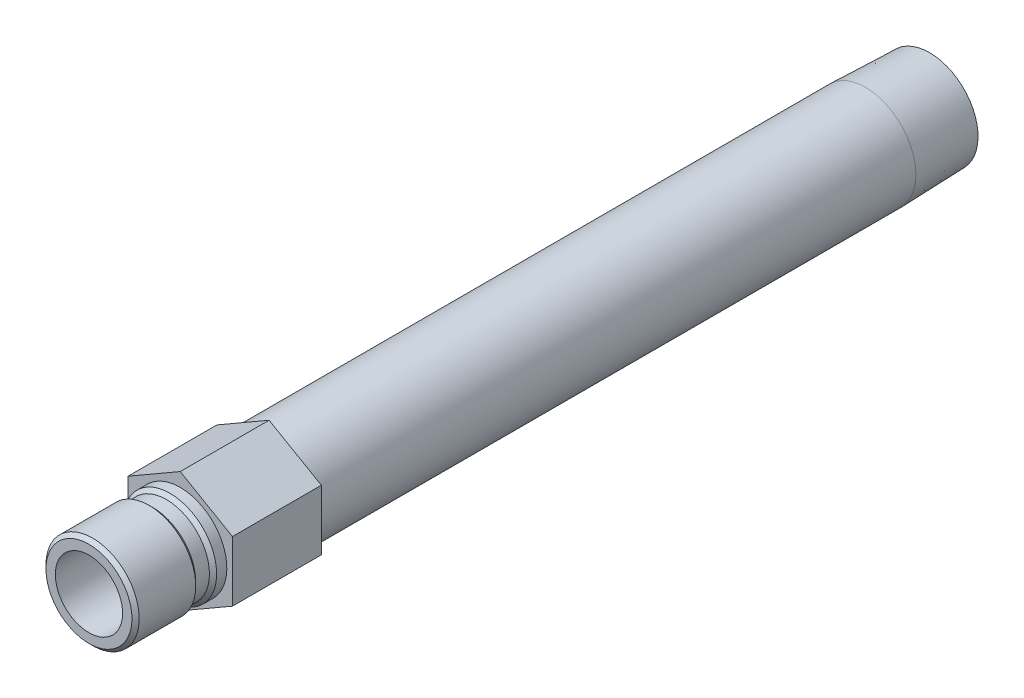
ISO-10303-21;
HEADER;
FILE_DESCRIPTION(('STEP AP214'),'2;1');
FILE_NAME('part.step','',(''),(''),'','','');
FILE_SCHEMA(('AUTOMOTIVE_DESIGN { 1 0 10303 214 1 1 1 1 }'));
ENDSEC;
DATA;
#1=APPLICATION_CONTEXT('core data for automotive mechanical design processes');
#2=APPLICATION_PROTOCOL_DEFINITION('international standard','automotive_design',2000,#1);
#3=PRODUCT_CONTEXT('',#1,'mechanical');
#4=PRODUCT('Part','Part','',(#3));
#5=PRODUCT_RELATED_PRODUCT_CATEGORY('part','',(#4));
#6=PRODUCT_DEFINITION_FORMATION('','',#4);
#7=PRODUCT_DEFINITION_CONTEXT('part definition',#1,'design');
#8=PRODUCT_DEFINITION('design','',#6,#7);
#9=PRODUCT_DEFINITION_SHAPE('','',#8);
#10=(LENGTH_UNIT() NAMED_UNIT(*) SI_UNIT(.MILLI.,.METRE.));
#11=(NAMED_UNIT(*) PLANE_ANGLE_UNIT() SI_UNIT($,.RADIAN.));
#12=(NAMED_UNIT(*) SI_UNIT($,.STERADIAN.) SOLID_ANGLE_UNIT());
#13=UNCERTAINTY_MEASURE_WITH_UNIT(LENGTH_MEASURE(1.E-05),#10,'distance_accuracy_value','');
#14=(GEOMETRIC_REPRESENTATION_CONTEXT(3) GLOBAL_UNCERTAINTY_ASSIGNED_CONTEXT((#13)) GLOBAL_UNIT_ASSIGNED_CONTEXT((#10,
#11,#12)) REPRESENTATION_CONTEXT('',''));
#15=CARTESIAN_POINT('',(0.,0.,0.));
#16=DIRECTION('',(0.,0.,1.));
#17=DIRECTION('',(1.,0.,0.));
#18=AXIS2_PLACEMENT_3D('',#15,#16,#17);
#19=CARTESIAN_POINT('',(0.,0.,0.));
#20=DIRECTION('',(0.,0.,-1.));
#21=DIRECTION('',(0.,1.,0.));
#22=AXIS2_PLACEMENT_3D('',#19,#20,#21);
#23=CYLINDRICAL_SURFACE('',#22,7.112);
#24=CARTESIAN_POINT('',(0.,0.,1.524));
#25=DIRECTION('',(0.,0.,-1.));
#26=DIRECTION('',(0.,1.,0.));
#27=AXIS2_PLACEMENT_3D('',#24,#25,#26);
#28=CIRCLE('',#27,7.112);
#29=CARTESIAN_POINT('',(0.,7.112,1.524));
#30=VERTEX_POINT('',#29);
#31=EDGE_CURVE('E147',#30,#30,#28,.T.);
#32=ORIENTED_EDGE('',*,*,#31,.T.);
#33=EDGE_LOOP('',(#32));
#34=FACE_BOUND('',#33,.T.);
#35=CARTESIAN_POINT('',(0.,0.,19.304));
#36=DIRECTION('',(0.,0.,-1.));
#37=DIRECTION('',(0.,1.,0.));
#38=AXIS2_PLACEMENT_3D('',#35,#36,#37);
#39=CIRCLE('',#38,7.112);
#40=CARTESIAN_POINT('',(0.,7.112,19.304));
#41=VERTEX_POINT('',#40);
#42=EDGE_CURVE('E42',#41,#41,#39,.T.);
#43=ORIENTED_EDGE('',*,*,#42,.F.);
#44=EDGE_LOOP('',(#43));
#45=FACE_BOUND('',#44,.T.);
#46=ADVANCED_FACE('F33',(#34,#45),#23,.F.);
#47=CARTESIAN_POINT('',(0.,7.112,19.304));
#48=DIRECTION('',(0.,0.,1.));
#49=DIRECTION('',(0.,-1.,0.));
#50=AXIS2_PLACEMENT_3D('',#47,#48,#49);
#51=PLANE('',#50);
#52=ORIENTED_EDGE('',*,*,#42,.T.);
#53=EDGE_LOOP('',(#52));
#54=FACE_BOUND('',#53,.T.);
#55=CARTESIAN_POINT('',(0.,0.,19.304));
#56=DIRECTION('',(0.,0.,-1.));
#57=DIRECTION('',(0.,1.,0.));
#58=AXIS2_PLACEMENT_3D('',#55,#56,#57);
#59=CIRCLE('',#58,9.0932);
#60=CARTESIAN_POINT('',(0.,9.0932,19.304));
#61=VERTEX_POINT('',#60);
#62=EDGE_CURVE('E180',#61,#61,#59,.T.);
#63=ORIENTED_EDGE('',*,*,#62,.F.);
#64=EDGE_LOOP('',(#63));
#65=FACE_BOUND('',#64,.T.);
#66=ADVANCED_FACE('F186',(#54,#65),#51,.T.);
#67=CARTESIAN_POINT('',(0.,0.,18.542));
#68=DIRECTION('',(0.,0.,-1.));
#69=DIRECTION('',(0.,1.,0.));
#70=AXIS2_PLACEMENT_3D('',#67,#68,#69);
#71=CONICAL_SURFACE('',#70,9.8552,0.785398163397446);
#72=ORIENTED_EDGE('',*,*,#62,.T.);
#73=EDGE_LOOP('',(#72));
#74=FACE_BOUND('',#73,.T.);
#75=CARTESIAN_POINT('',(0.,0.,18.542));
#76=DIRECTION('',(0.,0.,-1.));
#77=DIRECTION('',(0.,1.,0.));
#78=AXIS2_PLACEMENT_3D('',#75,#76,#77);
#79=CIRCLE('',#78,9.8552);
#80=CARTESIAN_POINT('',(0.,9.8552,18.542));
#81=VERTEX_POINT('',#80);
#82=EDGE_CURVE('E177',#81,#81,#79,.T.);
#83=ORIENTED_EDGE('',*,*,#82,.F.);
#84=EDGE_LOOP('',(#83));
#85=FACE_BOUND('',#84,.T.);
#86=ADVANCED_FACE('F194',(#74,#85),#71,.T.);
#87=CARTESIAN_POINT('',(0.,0.,0.));
#88=DIRECTION('',(0.,0.,-1.));
#89=DIRECTION('',(0.,1.,0.));
#90=AXIS2_PLACEMENT_3D('',#87,#88,#89);
#91=CYLINDRICAL_SURFACE('',#90,9.8552);
#92=ORIENTED_EDGE('',*,*,#82,.T.);
#93=EDGE_LOOP('',(#92));
#94=FACE_BOUND('',#93,.T.);
#95=CARTESIAN_POINT('',(0.,0.,6.5786));
#96=DIRECTION('',(0.,0.,-1.));
#97=DIRECTION('',(0.,1.,0.));
#98=AXIS2_PLACEMENT_3D('',#95,#96,#97);
#99=CIRCLE('',#98,9.8552);
#100=CARTESIAN_POINT('',(0.,9.8552,6.5786));
#101=VERTEX_POINT('',#100);
#102=EDGE_CURVE('E174',#101,#101,#99,.T.);
#103=ORIENTED_EDGE('',*,*,#102,.F.);
#104=EDGE_LOOP('',(#103));
#105=FACE_BOUND('',#104,.T.);
#106=ADVANCED_FACE('F249',(#94,#105),#91,.T.);
#107=CARTESIAN_POINT('',(0.,0.,5.8166));
#108=DIRECTION('',(0.,0.,1.));
#109=DIRECTION('',(0.,-1.,0.));
#110=AXIS2_PLACEMENT_3D('',#107,#108,#109);
#111=CONICAL_SURFACE('',#110,9.0932,0.785398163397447);
#112=ORIENTED_EDGE('',*,*,#102,.T.);
#113=EDGE_LOOP('',(#112));
#114=FACE_BOUND('',#113,.T.);
#115=CARTESIAN_POINT('',(0.,0.,5.8166));
#116=DIRECTION('',(0.,0.,-1.));
#117=DIRECTION('',(0.,1.,0.));
#118=AXIS2_PLACEMENT_3D('',#115,#116,#117);
#119=CIRCLE('',#118,9.0932);
#120=CARTESIAN_POINT('',(0.,9.0932,5.8166));
#121=VERTEX_POINT('',#120);
#122=EDGE_CURVE('E171',#121,#121,#119,.T.);
#123=ORIENTED_EDGE('',*,*,#122,.F.);
#124=EDGE_LOOP('',(#123));
#125=FACE_BOUND('',#124,.T.);
#126=ADVANCED_FACE('F245',(#114,#125),#111,.T.);
#127=CARTESIAN_POINT('',(0.,0.,0.));
#128=DIRECTION('',(0.,0.,-1.));
#129=DIRECTION('',(0.,1.,0.));
#130=AXIS2_PLACEMENT_3D('',#127,#128,#129);
#131=CYLINDRICAL_SURFACE('',#130,9.0932);
#132=ORIENTED_EDGE('',*,*,#122,.T.);
#133=EDGE_LOOP('',(#132));
#134=FACE_BOUND('',#133,.T.);
#135=CARTESIAN_POINT('',(0.,0.,2.921));
#136=DIRECTION('',(0.,0.,-1.));
#137=DIRECTION('',(0.,1.,0.));
#138=AXIS2_PLACEMENT_3D('',#135,#136,#137);
#139=CIRCLE('',#138,9.0932);
#140=CARTESIAN_POINT('',(0.,9.0932,2.921));
#141=VERTEX_POINT('',#140);
#142=EDGE_CURVE('E168',#141,#141,#139,.T.);
#143=ORIENTED_EDGE('',*,*,#142,.F.);
#144=EDGE_LOOP('',(#143));
#145=FACE_BOUND('',#144,.T.);
#146=ADVANCED_FACE('F241',(#134,#145),#131,.T.);
#147=CARTESIAN_POINT('',(0.,0.,2.159));
#148=DIRECTION('',(0.,0.,-1.));
#149=DIRECTION('',(0.,1.,0.));
#150=AXIS2_PLACEMENT_3D('',#147,#148,#149);
#151=CONICAL_SURFACE('',#150,9.8552,0.785398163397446);
#152=ORIENTED_EDGE('',*,*,#142,.T.);
#153=EDGE_LOOP('',(#152));
#154=FACE_BOUND('',#153,.T.);
#155=CARTESIAN_POINT('',(0.,0.,2.159));
#156=DIRECTION('',(0.,0.,-1.));
#157=DIRECTION('',(0.,1.,0.));
#158=AXIS2_PLACEMENT_3D('',#155,#156,#157);
#159=CIRCLE('',#158,9.8552);
#160=CARTESIAN_POINT('',(0.,9.8552,2.159));
#161=VERTEX_POINT('',#160);
#162=EDGE_CURVE('E165',#161,#161,#159,.T.);
#163=ORIENTED_EDGE('',*,*,#162,.F.);
#164=EDGE_LOOP('',(#163));
#165=FACE_BOUND('',#164,.T.);
#166=ADVANCED_FACE('F237',(#154,#165),#151,.T.);
#167=CARTESIAN_POINT('',(0.,0.,0.));
#168=DIRECTION('',(0.,0.,-1.));
#169=DIRECTION('',(0.,1.,0.));
#170=AXIS2_PLACEMENT_3D('',#167,#168,#169);
#171=CYLINDRICAL_SURFACE('',#170,9.8552);
#172=ORIENTED_EDGE('',*,*,#162,.T.);
#173=EDGE_LOOP('',(#172));
#174=FACE_BOUND('',#173,.T.);
#175=CARTESIAN_POINT('',(0.,0.,0.));
#176=DIRECTION('',(0.,0.,-1.));
#177=DIRECTION('',(0.,1.,0.));
#178=AXIS2_PLACEMENT_3D('',#175,#176,#177);
#179=CIRCLE('',#178,9.8552);
#180=CARTESIAN_POINT('',(0.,9.8552,0.));
#181=VERTEX_POINT('',#180);
#182=EDGE_CURVE('E162',#181,#181,#179,.T.);
#183=ORIENTED_EDGE('',*,*,#182,.F.);
#184=EDGE_LOOP('',(#183));
#185=FACE_BOUND('',#184,.T.);
#186=ADVANCED_FACE('F233',(#174,#185),#171,.T.);
#187=CARTESIAN_POINT('',(0.,9.8552,0.));
#188=DIRECTION('',(0.,0.,1.));
#189=DIRECTION('',(0.,-1.,0.));
#190=AXIS2_PLACEMENT_3D('',#187,#188,#189);
#191=PLANE('',#190);
#192=ORIENTED_EDGE('',*,*,#182,.T.);
#193=EDGE_LOOP('',(#192));
#194=FACE_BOUND('',#193,.T.);
#195=DIRECTION('',(-0.866025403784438,-0.5,0.));
#196=VECTOR('',#195,1.);
#197=CARTESIAN_POINT('',(0.,12.7582862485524,0.));
#198=LINE('',#197,#196);
#199=CARTESIAN_POINT('',(0.,12.7582862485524,0.));
#200=VERTEX_POINT('',#199);
#201=CARTESIAN_POINT('',(-11.049,6.37914312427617,0.));
#202=VERTEX_POINT('',#201);
#203=EDGE_CURVE('E121',#200,#202,#198,.T.);
#204=ORIENTED_EDGE('',*,*,#203,.T.);
#205=DIRECTION('',(0.,-1.,0.));
#206=VECTOR('',#205,1.);
#207=CARTESIAN_POINT('',(-11.049,6.37914312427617,0.));
#208=LINE('',#207,#206);
#209=CARTESIAN_POINT('',(-11.049,-6.37914312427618,0.));
#210=VERTEX_POINT('',#209);
#211=EDGE_CURVE('E124',#202,#210,#208,.T.);
#212=ORIENTED_EDGE('',*,*,#211,.T.);
#213=DIRECTION('',(0.866025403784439,-0.5,0.));
#214=VECTOR('',#213,1.);
#215=CARTESIAN_POINT('',(-11.049,-6.37914312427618,0.));
#216=LINE('',#215,#214);
#217=CARTESIAN_POINT('',(0.,-12.7582862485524,0.));
#218=VERTEX_POINT('',#217);
#219=EDGE_CURVE('E128',#210,#218,#216,.T.);
#220=ORIENTED_EDGE('',*,*,#219,.T.);
#221=DIRECTION('',(0.866025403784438,0.5,0.));
#222=VECTOR('',#221,1.);
#223=CARTESIAN_POINT('',(0.,-12.7582862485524,0.));
#224=LINE('',#223,#222);
#225=CARTESIAN_POINT('',(11.049,-6.37914312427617,0.));
#226=VERTEX_POINT('',#225);
#227=EDGE_CURVE('E131',#218,#226,#224,.T.);
#228=ORIENTED_EDGE('',*,*,#227,.T.);
#229=DIRECTION('',(0.,1.,0.));
#230=VECTOR('',#229,1.);
#231=CARTESIAN_POINT('',(11.049,-6.37914312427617,0.));
#232=LINE('',#231,#230);
#233=CARTESIAN_POINT('',(11.049,6.37914312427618,0.));
#234=VERTEX_POINT('',#233);
#235=EDGE_CURVE('E98',#226,#234,#232,.T.);
#236=ORIENTED_EDGE('',*,*,#235,.T.);
#237=DIRECTION('',(-0.866025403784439,0.5,0.));
#238=VECTOR('',#237,1.);
#239=CARTESIAN_POINT('',(11.049,6.37914312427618,0.));
#240=LINE('',#239,#238);
#241=EDGE_CURVE('E134',#234,#200,#240,.T.);
#242=ORIENTED_EDGE('',*,*,#241,.T.);
#243=EDGE_LOOP('',(#204,#212,#220,#228,#236,#242));
#244=FACE_BOUND('',#243,.T.);
#245=ADVANCED_FACE('F210',(#194,#244),#191,.T.);
#246=CARTESIAN_POINT('',(0.,0.,0.));
#247=DIRECTION('',(0.,0.,-1.));
#248=DIRECTION('',(0.,1.,0.));
#249=AXIS2_PLACEMENT_3D('',#246,#247,#248);
#250=CYLINDRICAL_SURFACE('',#249,7.89939999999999);
#251=CARTESIAN_POINT('',(0.,0.,0.));
#252=DIRECTION('',(0.,0.,1.));
#253=DIRECTION('',(1.,0.,0.));
#254=AXIS2_PLACEMENT_3D('',#251,#252,#253);
#255=CIRCLE('',#254,7.89939999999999);
#256=CARTESIAN_POINT('',(7.89939999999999,0.,0.));
#257=VERTEX_POINT('',#256);
#258=EDGE_CURVE('E11',#257,#257,#255,.T.);
#259=ORIENTED_EDGE('',*,*,#258,.F.);
#260=EDGE_LOOP('',(#259));
#261=FACE_BOUND('',#260,.T.);
#262=CARTESIAN_POINT('',(0.,0.,1.10533199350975));
#263=DIRECTION('',(0.,0.,-1.));
#264=DIRECTION('',(0.,1.,0.));
#265=AXIS2_PLACEMENT_3D('',#262,#263,#264);
#266=CIRCLE('',#265,7.8994);
#267=CARTESIAN_POINT('',(0.,7.8994,1.10533199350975));
#268=VERTEX_POINT('',#267);
#269=EDGE_CURVE('E150',#268,#268,#266,.T.);
#270=ORIENTED_EDGE('',*,*,#269,.F.);
#271=EDGE_LOOP('',(#270));
#272=FACE_BOUND('',#271,.T.);
#273=ADVANCED_FACE('F200',(#261,#272),#250,.F.);
#274=CARTESIAN_POINT('',(0.,0.,1.524));
#275=DIRECTION('',(0.,0.,-1.));
#276=DIRECTION('',(0.,1.,0.));
#277=AXIS2_PLACEMENT_3D('',#274,#275,#276);
#278=CONICAL_SURFACE('',#277,7.112,1.08210413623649);
#279=ORIENTED_EDGE('',*,*,#269,.T.);
#280=EDGE_LOOP('',(#279));
#281=FACE_BOUND('',#280,.T.);
#282=ORIENTED_EDGE('',*,*,#31,.F.);
#283=EDGE_LOOP('',(#282));
#284=FACE_BOUND('',#283,.T.);
#285=ADVANCED_FACE('F197',(#281,#284),#278,.F.);
#286=CARTESIAN_POINT('',(-11.049,6.37914312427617,-18.796));
#287=DIRECTION('',(0.,0.,1.));
#288=DIRECTION('',(1.,0.,0.));
#289=AXIS2_PLACEMENT_3D('',#286,#287,#288);
#290=PLANE('',#289);
#291=CARTESIAN_POINT('',(0.,0.,-18.796));
#292=DIRECTION('',(0.,0.,1.));
#293=DIRECTION('',(1.,0.,0.));
#294=AXIS2_PLACEMENT_3D('',#291,#292,#293);
#295=CIRCLE('',#294,7.89939999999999);
#296=CARTESIAN_POINT('',(7.89939999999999,0.,-18.796));
#297=VERTEX_POINT('',#296);
#298=EDGE_CURVE('E36',#297,#297,#295,.T.);
#299=ORIENTED_EDGE('',*,*,#298,.F.);
#300=EDGE_LOOP('',(#299));
#301=FACE_BOUND('',#300,.T.);
#302=CARTESIAN_POINT('',(0.,0.,-18.796));
#303=DIRECTION('',(0.,0.,1.));
#304=DIRECTION('',(1.,0.,0.));
#305=AXIS2_PLACEMENT_3D('',#302,#303,#304);
#306=CIRCLE('',#305,7.112);
#307=CARTESIAN_POINT('',(7.112,0.,-18.796));
#308=VERTEX_POINT('',#307);
#309=EDGE_CURVE('E125',#308,#308,#306,.T.);
#310=ORIENTED_EDGE('',*,*,#309,.T.);
#311=EDGE_LOOP('',(#310));
#312=FACE_BOUND('',#311,.T.);
#313=ADVANCED_FACE('F199',(#301,#312),#290,.F.);
#314=CARTESIAN_POINT('',(0.,0.,-18.796));
#315=DIRECTION('',(0.,0.,1.));
#316=DIRECTION('',(1.,0.,0.));
#317=AXIS2_PLACEMENT_3D('',#314,#315,#316);
#318=CYLINDRICAL_SURFACE('',#317,7.112);
#319=ORIENTED_EDGE('',*,*,#309,.F.);
#320=EDGE_LOOP('',(#319));
#321=FACE_BOUND('',#320,.T.);
#322=CARTESIAN_POINT('',(0.,0.,0.));
#323=DIRECTION('',(0.,0.,1.));
#324=DIRECTION('',(1.,0.,0.));
#325=AXIS2_PLACEMENT_3D('',#322,#323,#324);
#326=CIRCLE('',#325,7.112);
#327=CARTESIAN_POINT('',(7.112,0.,0.));
#328=VERTEX_POINT('',#327);
#329=EDGE_CURVE('E443',#328,#328,#326,.T.);
#330=ORIENTED_EDGE('',*,*,#329,.T.);
#331=EDGE_LOOP('',(#330));
#332=FACE_BOUND('',#331,.T.);
#333=ADVANCED_FACE('F207',(#321,#332),#318,.F.);
#334=CARTESIAN_POINT('',(-11.049,6.37914312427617,0.));
#335=DIRECTION('',(0.,0.,1.));
#336=DIRECTION('',(1.,0.,0.));
#337=AXIS2_PLACEMENT_3D('',#334,#335,#336);
#338=PLANE('',#337);
#339=ORIENTED_EDGE('',*,*,#258,.T.);
#340=EDGE_LOOP('',(#339));
#341=FACE_BOUND('',#340,.T.);
#342=ORIENTED_EDGE('',*,*,#329,.F.);
#343=EDGE_LOOP('',(#342));
#344=FACE_BOUND('',#343,.T.);
#345=ADVANCED_FACE('F221',(#341,#344),#338,.T.);
#346=CARTESIAN_POINT('',(0.,10.244140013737,-158.496));
#347=DIRECTION('',(0.,0.,-1.));
#348=DIRECTION('',(0.,1.,0.));
#349=AXIS2_PLACEMENT_3D('',#346,#347,#348);
#350=PLANE('',#349);
#351=CARTESIAN_POINT('',(0.,0.,-158.496));
#352=DIRECTION('',(0.,0.,-1.));
#353=DIRECTION('',(0.,1.,0.));
#354=AXIS2_PLACEMENT_3D('',#351,#352,#353);
#355=CIRCLE('',#354,10.2441400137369);
#356=CARTESIAN_POINT('',(0.,10.244140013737,-158.496));
#357=VERTEX_POINT('',#356);
#358=EDGE_CURVE('E156',#357,#357,#355,.T.);
#359=ORIENTED_EDGE('',*,*,#358,.T.);
#360=EDGE_LOOP('',(#359));
#361=FACE_BOUND('',#360,.T.);
#362=CARTESIAN_POINT('',(0.,0.,-158.496));
#363=DIRECTION('',(0.,0.,-1.));
#364=DIRECTION('',(0.,1.,0.));
#365=AXIS2_PLACEMENT_3D('',#362,#363,#364);
#366=CIRCLE('',#365,7.89939999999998);
#367=CARTESIAN_POINT('',(0.,7.8994,-158.496));
#368=VERTEX_POINT('',#367);
#369=EDGE_CURVE('E153',#368,#368,#366,.T.);
#370=ORIENTED_EDGE('',*,*,#369,.F.);
#371=EDGE_LOOP('',(#370));
#372=FACE_BOUND('',#371,.T.);
#373=ADVANCED_FACE('F218',(#361,#372),#350,.T.);
#374=ORIENTED_EDGE('',*,*,#369,.T.);
#375=EDGE_LOOP('',(#374));
#376=FACE_BOUND('',#375,.T.);
#377=ORIENTED_EDGE('',*,*,#298,.T.);
#378=EDGE_LOOP('',(#377));
#379=FACE_BOUND('',#378,.T.);
#380=ADVANCED_FACE('F213',(#376,#379),#250,.F.);
#381=CARTESIAN_POINT('',(0.,0.,-158.496));
#382=DIRECTION('',(0.,0.,1.));
#383=DIRECTION('',(0.,-1.,0.));
#384=AXIS2_PLACEMENT_3D('',#381,#382,#383);
#385=CONICAL_SURFACE('',#384,10.2441400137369,0.0312396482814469);
#386=CARTESIAN_POINT('',(0.,0.,-144.9324));
#387=DIRECTION('',(0.,0.,-1.));
#388=DIRECTION('',(0.,1.,0.));
#389=AXIS2_PLACEMENT_3D('',#386,#387,#388);
#390=CIRCLE('',#389,10.668);
#391=CARTESIAN_POINT('',(0.,10.668,-144.9324));
#392=VERTEX_POINT('',#391);
#393=EDGE_CURVE('E159',#392,#392,#390,.T.);
#394=ORIENTED_EDGE('',*,*,#393,.T.);
#395=EDGE_LOOP('',(#394));
#396=FACE_BOUND('',#395,.T.);
#397=ORIENTED_EDGE('',*,*,#358,.F.);
#398=EDGE_LOOP('',(#397));
#399=FACE_BOUND('',#398,.T.);
#400=ADVANCED_FACE('F223',(#396,#399),#385,.T.);
#401=CARTESIAN_POINT('',(0.,0.,0.));
#402=DIRECTION('',(0.,0.,-1.));
#403=DIRECTION('',(0.,1.,0.));
#404=AXIS2_PLACEMENT_3D('',#401,#402,#403);
#405=CYLINDRICAL_SURFACE('',#404,10.668);
#406=ORIENTED_EDGE('',*,*,#393,.F.);
#407=EDGE_LOOP('',(#406));
#408=FACE_BOUND('',#407,.T.);
#409=CARTESIAN_POINT('',(0.,0.,-18.796));
#410=DIRECTION('',(0.,0.,1.));
#411=DIRECTION('',(1.,0.,0.));
#412=AXIS2_PLACEMENT_3D('',#409,#410,#411);
#413=CIRCLE('',#412,10.668);
#414=CARTESIAN_POINT('',(10.668,0.,-18.796));
#415=VERTEX_POINT('',#414);
#416=EDGE_CURVE('E144',#415,#415,#413,.F.);
#417=ORIENTED_EDGE('',*,*,#416,.T.);
#418=EDGE_LOOP('',(#417));
#419=FACE_BOUND('',#418,.T.);
#420=ADVANCED_FACE('F226',(#408,#419),#405,.T.);
#421=ORIENTED_EDGE('',*,*,#416,.F.);
#422=EDGE_LOOP('',(#421));
#423=FACE_BOUND('',#422,.T.);
#424=DIRECTION('',(-0.866025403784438,-0.5,0.));
#425=VECTOR('',#424,1.);
#426=CARTESIAN_POINT('',(0.,12.7582862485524,-18.796));
#427=LINE('',#426,#425);
#428=CARTESIAN_POINT('',(0.,12.7582862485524,-18.796));
#429=VERTEX_POINT('',#428);
#430=CARTESIAN_POINT('',(-11.049,6.37914312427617,-18.796));
#431=VERTEX_POINT('',#430);
#432=EDGE_CURVE('E137',#429,#431,#427,.T.);
#433=ORIENTED_EDGE('',*,*,#432,.F.);
#434=DIRECTION('',(-0.866025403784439,0.5,0.));
#435=VECTOR('',#434,1.);
#436=CARTESIAN_POINT('',(11.049,6.37914312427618,-18.796));
#437=LINE('',#436,#435);
#438=CARTESIAN_POINT('',(11.049,6.37914312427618,-18.796));
#439=VERTEX_POINT('',#438);
#440=EDGE_CURVE('E111',#439,#429,#437,.T.);
#441=ORIENTED_EDGE('',*,*,#440,.F.);
#442=DIRECTION('',(0.,1.,0.));
#443=VECTOR('',#442,1.);
#444=CARTESIAN_POINT('',(11.049,-6.37914312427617,-18.796));
#445=LINE('',#444,#443);
#446=CARTESIAN_POINT('',(11.049,-6.37914312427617,-18.796));
#447=VERTEX_POINT('',#446);
#448=EDGE_CURVE('E96',#447,#439,#445,.T.);
#449=ORIENTED_EDGE('',*,*,#448,.F.);
#450=DIRECTION('',(0.866025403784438,0.5,0.));
#451=VECTOR('',#450,1.);
#452=CARTESIAN_POINT('',(0.,-12.7582862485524,-18.796));
#453=LINE('',#452,#451);
#454=CARTESIAN_POINT('',(0.,-12.7582862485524,-18.796));
#455=VERTEX_POINT('',#454);
#456=EDGE_CURVE('E109',#455,#447,#453,.T.);
#457=ORIENTED_EDGE('',*,*,#456,.F.);
#458=DIRECTION('',(0.866025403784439,-0.5,0.));
#459=VECTOR('',#458,1.);
#460=CARTESIAN_POINT('',(-11.049,-6.37914312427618,-18.796));
#461=LINE('',#460,#459);
#462=CARTESIAN_POINT('',(-11.049,-6.37914312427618,-18.796));
#463=VERTEX_POINT('',#462);
#464=EDGE_CURVE('E114',#463,#455,#461,.T.);
#465=ORIENTED_EDGE('',*,*,#464,.F.);
#466=DIRECTION('',(0.,-1.,0.));
#467=VECTOR('',#466,1.);
#468=CARTESIAN_POINT('',(-11.049,6.37914312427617,-18.796));
#469=LINE('',#468,#467);
#470=EDGE_CURVE('E116',#431,#463,#469,.T.);
#471=ORIENTED_EDGE('',*,*,#470,.F.);
#472=EDGE_LOOP('',(#433,#441,#449,#457,#465,#471));
#473=FACE_BOUND('',#472,.T.);
#474=ADVANCED_FACE('F107',(#423,#473),#290,.F.);
#475=CARTESIAN_POINT('',(0.,12.7582862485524,-18.796));
#476=DIRECTION('',(-0.5,0.866025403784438,0.));
#477=DIRECTION('',(-0.866025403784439,-0.5,0.));
#478=AXIS2_PLACEMENT_3D('',#475,#476,#477);
#479=PLANE('',#478);
#480=ORIENTED_EDGE('',*,*,#203,.F.);
#481=DIRECTION('',(0.,0.,1.));
#482=VECTOR('',#481,1.);
#483=CARTESIAN_POINT('',(0.,12.7582862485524,-18.796));
#484=LINE('',#483,#482);
#485=EDGE_CURVE('E50',#429,#200,#484,.T.);
#486=ORIENTED_EDGE('',*,*,#485,.F.);
#487=ORIENTED_EDGE('',*,*,#432,.T.);
#488=DIRECTION('',(0.,0.,1.));
#489=VECTOR('',#488,1.);
#490=CARTESIAN_POINT('',(-11.049,6.37914312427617,-18.796));
#491=LINE('',#490,#489);
#492=EDGE_CURVE('E85',#431,#202,#491,.T.);
#493=ORIENTED_EDGE('',*,*,#492,.T.);
#494=EDGE_LOOP('',(#480,#486,#487,#493));
#495=FACE_BOUND('',#494,.T.);
#496=ADVANCED_FACE('F215',(#495),#479,.T.);
#497=CARTESIAN_POINT('',(11.049,6.37914312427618,-18.796));
#498=DIRECTION('',(0.5,0.866025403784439,0.));
#499=DIRECTION('',(-0.866025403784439,0.5,0.));
#500=AXIS2_PLACEMENT_3D('',#497,#498,#499);
#501=PLANE('',#500);
#502=ORIENTED_EDGE('',*,*,#241,.F.);
#503=DIRECTION('',(0.,0.,1.));
#504=VECTOR('',#503,1.);
#505=CARTESIAN_POINT('',(11.049,6.37914312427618,-18.796));
#506=LINE('',#505,#504);
#507=EDGE_CURVE('E73',#439,#234,#506,.T.);
#508=ORIENTED_EDGE('',*,*,#507,.F.);
#509=ORIENTED_EDGE('',*,*,#440,.T.);
#510=ORIENTED_EDGE('',*,*,#485,.T.);
#511=EDGE_LOOP('',(#502,#508,#509,#510));
#512=FACE_BOUND('',#511,.T.);
#513=ADVANCED_FACE('F276',(#512),#501,.T.);
#514=CARTESIAN_POINT('',(11.049,-6.37914312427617,-18.796));
#515=DIRECTION('',(1.,0.,0.));
#516=DIRECTION('',(0.,1.,0.));
#517=AXIS2_PLACEMENT_3D('',#514,#515,#516);
#518=PLANE('',#517);
#519=ORIENTED_EDGE('',*,*,#235,.F.);
#520=DIRECTION('',(0.,0.,1.));
#521=VECTOR('',#520,1.);
#522=CARTESIAN_POINT('',(11.049,-6.37914312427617,-18.796));
#523=LINE('',#522,#521);
#524=EDGE_CURVE('E93',#447,#226,#523,.T.);
#525=ORIENTED_EDGE('',*,*,#524,.F.);
#526=ORIENTED_EDGE('',*,*,#448,.T.);
#527=ORIENTED_EDGE('',*,*,#507,.T.);
#528=EDGE_LOOP('',(#519,#525,#526,#527));
#529=FACE_BOUND('',#528,.T.);
#530=ADVANCED_FACE('F95',(#529),#518,.T.);
#531=CARTESIAN_POINT('',(0.,-12.7582862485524,-18.796));
#532=DIRECTION('',(0.5,-0.866025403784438,0.));
#533=DIRECTION('',(0.866025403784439,0.5,0.));
#534=AXIS2_PLACEMENT_3D('',#531,#532,#533);
#535=PLANE('',#534);
#536=ORIENTED_EDGE('',*,*,#227,.F.);
#537=DIRECTION('',(0.,0.,1.));
#538=VECTOR('',#537,1.);
#539=CARTESIAN_POINT('',(0.,-12.7582862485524,-18.796));
#540=LINE('',#539,#538);
#541=EDGE_CURVE('E103',#455,#218,#540,.T.);
#542=ORIENTED_EDGE('',*,*,#541,.F.);
#543=ORIENTED_EDGE('',*,*,#456,.T.);
#544=ORIENTED_EDGE('',*,*,#524,.T.);
#545=EDGE_LOOP('',(#536,#542,#543,#544));
#546=FACE_BOUND('',#545,.T.);
#547=ADVANCED_FACE('F113',(#546),#535,.T.);
#548=CARTESIAN_POINT('',(-11.049,-6.37914312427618,-18.796));
#549=DIRECTION('',(-0.5,-0.866025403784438,0.));
#550=DIRECTION('',(0.866025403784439,-0.5,0.));
#551=AXIS2_PLACEMENT_3D('',#548,#549,#550);
#552=PLANE('',#551);
#553=ORIENTED_EDGE('',*,*,#219,.F.);
#554=DIRECTION('',(0.,0.,1.));
#555=VECTOR('',#554,1.);
#556=CARTESIAN_POINT('',(-11.049,-6.37914312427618,-18.796));
#557=LINE('',#556,#555);
#558=EDGE_CURVE('E141',#463,#210,#557,.T.);
#559=ORIENTED_EDGE('',*,*,#558,.F.);
#560=ORIENTED_EDGE('',*,*,#464,.T.);
#561=ORIENTED_EDGE('',*,*,#541,.T.);
#562=EDGE_LOOP('',(#553,#559,#560,#561));
#563=FACE_BOUND('',#562,.T.);
#564=ADVANCED_FACE('F275',(#563),#552,.T.);
#565=CARTESIAN_POINT('',(-11.049,6.37914312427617,-18.796));
#566=DIRECTION('',(-1.,0.,0.));
#567=DIRECTION('',(0.,0.,1.));
#568=AXIS2_PLACEMENT_3D('',#565,#566,#567);
#569=PLANE('',#568);
#570=ORIENTED_EDGE('',*,*,#211,.F.);
#571=ORIENTED_EDGE('',*,*,#492,.F.);
#572=ORIENTED_EDGE('',*,*,#470,.T.);
#573=ORIENTED_EDGE('',*,*,#558,.T.);
#574=EDGE_LOOP('',(#570,#571,#572,#573));
#575=FACE_BOUND('',#574,.T.);
#576=ADVANCED_FACE('F272',(#575),#569,.T.);
#577=CLOSED_SHELL('',(#46,#66,#86,#106,#126,#146,#166,#186,#245,#273,#285,#313,#333,#345,#373,
#380,#400,#420,#474,#496,#513,#530,#547,#564,#576));
#578=MANIFOLD_SOLID_BREP('B2',#577);
#579=ADVANCED_BREP_SHAPE_REPRESENTATION('',(#18,#578),#14);
#580=SHAPE_DEFINITION_REPRESENTATION(#9,#579);
ENDSEC;
END-ISO-10303-21;
